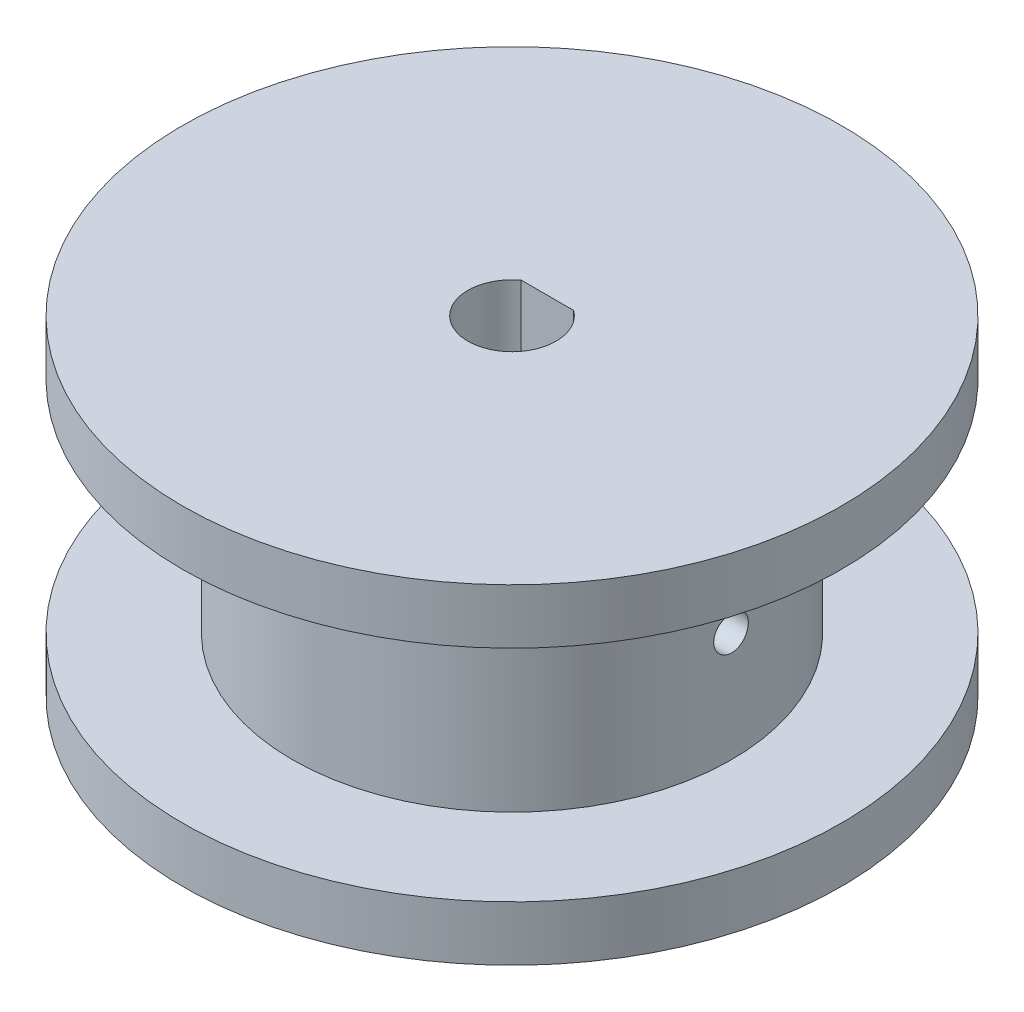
ISO-10303-21;
HEADER;
FILE_DESCRIPTION(('STEP AP214'),'2;1');
FILE_NAME('part.step','',(''),(''),'','','');
FILE_SCHEMA(('AUTOMOTIVE_DESIGN { 1 0 10303 214 1 1 1 1 }'));
ENDSEC;
DATA;
#1=APPLICATION_CONTEXT('core data for automotive mechanical design processes');
#2=APPLICATION_PROTOCOL_DEFINITION('international standard','automotive_design',2000,#1);
#3=PRODUCT_CONTEXT('',#1,'mechanical');
#4=PRODUCT('Part','Part','',(#3));
#5=PRODUCT_RELATED_PRODUCT_CATEGORY('part','',(#4));
#6=PRODUCT_DEFINITION_FORMATION('','',#4);
#7=PRODUCT_DEFINITION_CONTEXT('part definition',#1,'design');
#8=PRODUCT_DEFINITION('design','',#6,#7);
#9=PRODUCT_DEFINITION_SHAPE('','',#8);
#10=(LENGTH_UNIT() NAMED_UNIT(*) SI_UNIT(.MILLI.,.METRE.));
#11=(NAMED_UNIT(*) PLANE_ANGLE_UNIT() SI_UNIT($,.RADIAN.));
#12=(NAMED_UNIT(*) SI_UNIT($,.STERADIAN.) SOLID_ANGLE_UNIT());
#13=UNCERTAINTY_MEASURE_WITH_UNIT(LENGTH_MEASURE(1.E-05),#10,'distance_accuracy_value','');
#14=(GEOMETRIC_REPRESENTATION_CONTEXT(3) GLOBAL_UNCERTAINTY_ASSIGNED_CONTEXT((#13)) GLOBAL_UNIT_ASSIGNED_CONTEXT((#10,
#11,#12)) REPRESENTATION_CONTEXT('',''));
#15=CARTESIAN_POINT('',(0.,0.,0.));
#16=DIRECTION('',(0.,0.,1.));
#17=DIRECTION('',(1.,0.,0.));
#18=AXIS2_PLACEMENT_3D('',#15,#16,#17);
#19=CARTESIAN_POINT('',(0.,-3.175,0.));
#20=DIRECTION('',(0.,-1.,0.));
#21=DIRECTION('',(0.,0.,-1.));
#22=AXIS2_PLACEMENT_3D('',#19,#20,#21);
#23=PLANE('',#22);
#24=CARTESIAN_POINT('',(0.,-3.175,0.));
#25=DIRECTION('',(0.,-1.,0.));
#26=DIRECTION('',(0.,0.,-1.));
#27=AXIS2_PLACEMENT_3D('',#24,#25,#26);
#28=CIRCLE('',#27,19.05);
#29=CARTESIAN_POINT('',(0.,-3.175,-19.05));
#30=VERTEX_POINT('',#29);
#31=EDGE_CURVE('E205',#30,#30,#28,.T.);
#32=ORIENTED_EDGE('',*,*,#31,.T.);
#33=EDGE_LOOP('',(#32));
#34=FACE_BOUND('',#33,.T.);
#35=CARTESIAN_POINT('',(0.,-3.175,0.));
#36=DIRECTION('',(0.,-1.,0.));
#37=DIRECTION('',(0.,0.,-1.));
#38=AXIS2_PLACEMENT_3D('',#35,#36,#37);
#39=CIRCLE('',#38,5.725);
#40=CARTESIAN_POINT('',(0.,-3.175,-5.725));
#41=VERTEX_POINT('',#40);
#42=EDGE_CURVE('E194',#41,#41,#39,.T.);
#43=ORIENTED_EDGE('',*,*,#42,.F.);
#44=EDGE_LOOP('',(#43));
#45=FACE_BOUND('',#44,.T.);
#46=ADVANCED_FACE('F45',(#34,#45),#23,.T.);
#47=CARTESIAN_POINT('',(0.,12.7,0.));
#48=DIRECTION('',(0.,-1.,0.));
#49=DIRECTION('',(0.,0.,-1.));
#50=AXIS2_PLACEMENT_3D('',#47,#48,#49);
#51=CYLINDRICAL_SURFACE('',#50,12.7);
#52=CARTESIAN_POINT('',(-12.6605687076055,6.35,-1.));
#53=CARTESIAN_POINT('',(-12.6605692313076,6.40607694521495,-0.999997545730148));
#54=CARTESIAN_POINT('',(-12.6609452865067,6.46219233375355,-0.995267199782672));
#55=CARTESIAN_POINT('',(-12.6624089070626,6.57287124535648,-0.976466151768));
#56=CARTESIAN_POINT('',(-12.6634972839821,6.62743292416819,-0.962384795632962));
#57=CARTESIAN_POINT('',(-12.6662615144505,6.73338534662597,-0.925290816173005));
#58=CARTESIAN_POINT('',(-12.6679370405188,6.78477783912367,-0.902283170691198));
#59=CARTESIAN_POINT('',(-12.6716863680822,6.88295894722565,-0.847998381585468));
#60=CARTESIAN_POINT('',(-12.6737600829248,6.92974856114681,-0.816723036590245));
#61=CARTESIAN_POINT('',(-12.6780775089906,7.01751616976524,-0.746712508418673));
#62=CARTESIAN_POINT('',(-12.6803215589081,7.05848209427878,-0.707962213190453));
#63=CARTESIAN_POINT('',(-12.6847236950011,7.13333583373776,-0.624133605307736));
#64=CARTESIAN_POINT('',(-12.6868817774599,7.16722334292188,-0.579055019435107));
#65=CARTESIAN_POINT('',(-12.6908719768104,7.22699790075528,-0.483778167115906));
#66=CARTESIAN_POINT('',(-12.6927036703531,7.25287459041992,-0.43357338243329));
#67=CARTESIAN_POINT('',(-12.6958310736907,7.29582669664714,-0.329514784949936));
#68=CARTESIAN_POINT('',(-12.6971267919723,7.3129022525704,-0.275661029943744));
#69=CARTESIAN_POINT('',(-12.6990338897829,7.33773286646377,-0.165952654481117));
#70=CARTESIAN_POINT('',(-12.69964669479,7.34550734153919,-0.110102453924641));
#71=CARTESIAN_POINT('',(-12.7001237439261,7.35157511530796,0.00211328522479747));
#72=CARTESIAN_POINT('',(-12.6999880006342,7.34986857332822,0.058478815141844));
#73=CARTESIAN_POINT('',(-12.698984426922,7.33703866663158,0.169993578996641));
#74=CARTESIAN_POINT('',(-12.6981182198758,7.32593618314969,0.2251452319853));
#75=CARTESIAN_POINT('',(-12.6957530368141,7.2946620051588,0.332799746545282));
#76=CARTESIAN_POINT('',(-12.6942540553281,7.27449023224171,0.385302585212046));
#77=CARTESIAN_POINT('',(-12.6907891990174,7.22562671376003,0.486235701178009));
#78=CARTESIAN_POINT('',(-12.6888228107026,7.19692558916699,0.534661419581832));
#79=CARTESIAN_POINT('',(-12.6846442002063,7.1318248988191,0.626015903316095));
#80=CARTESIAN_POINT('',(-12.6824319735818,7.09542519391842,0.668944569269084));
#81=CARTESIAN_POINT('',(-12.6780033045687,7.01584284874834,0.748208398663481));
#82=CARTESIAN_POINT('',(-12.6757868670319,6.97264206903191,0.784525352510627));
#83=CARTESIAN_POINT('',(-12.6716056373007,6.88074718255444,0.849394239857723));
#84=CARTESIAN_POINT('',(-12.669640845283,6.83205307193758,0.877946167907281));
#85=CARTESIAN_POINT('',(-12.6661849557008,6.73054128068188,0.926473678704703));
#86=CARTESIAN_POINT('',(-12.6646939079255,6.67772316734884,0.946448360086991));
#87=CARTESIAN_POINT('',(-12.6623552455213,6.56946858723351,0.977241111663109));
#88=CARTESIAN_POINT('',(-12.6615076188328,6.51403216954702,0.988059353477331));
#89=CARTESIAN_POINT('',(-12.6605536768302,6.40227383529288,1.00020917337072));
#90=CARTESIAN_POINT('',(-12.6604453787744,6.34595469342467,1.00156612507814));
#91=CARTESIAN_POINT('',(-12.6609771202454,6.23388970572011,0.994821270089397));
#92=CARTESIAN_POINT('',(-12.6616171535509,6.17814385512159,0.986719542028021));
#93=CARTESIAN_POINT('',(-12.6635716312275,6.06888044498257,0.96130844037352));
#94=CARTESIAN_POINT('',(-12.6648852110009,6.01536012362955,0.944010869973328));
#95=CARTESIAN_POINT('',(-12.6680380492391,5.91198153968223,0.900711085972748));
#96=CARTESIAN_POINT('',(-12.6698773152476,5.86212332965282,0.874708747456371));
#97=CARTESIAN_POINT('',(-12.6738790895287,5.7673680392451,0.814673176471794));
#98=CARTESIAN_POINT('',(-12.6760422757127,5.72248171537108,0.780623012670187));
#99=CARTESIAN_POINT('',(-12.6804458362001,5.63905298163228,0.705482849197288));
#100=CARTESIAN_POINT('',(-12.6826862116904,5.60051066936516,0.6643927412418));
#101=CARTESIAN_POINT('',(-12.6869975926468,5.53077764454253,0.576229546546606));
#102=CARTESIAN_POINT('',(-12.6890682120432,5.4996034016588,0.529143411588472));
#103=CARTESIAN_POINT('',(-12.6928012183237,5.44560436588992,0.43038992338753));
#104=CARTESIAN_POINT('',(-12.6944636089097,5.42277949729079,0.378722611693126));
#105=CARTESIAN_POINT('',(-12.6971910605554,5.38615549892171,0.272332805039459));
#106=CARTESIAN_POINT('',(-12.6982567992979,5.37234612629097,0.21761385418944));
#107=CARTESIAN_POINT('',(-12.6996736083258,5.35411162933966,0.106625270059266));
#108=CARTESIAN_POINT('',(-12.7000246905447,5.34968634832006,0.050355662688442));
#109=CARTESIAN_POINT('',(-12.6999726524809,5.35034739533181,-0.0619744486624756));
#110=CARTESIAN_POINT('',(-12.6995715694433,5.35540803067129,-0.118035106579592));
#111=CARTESIAN_POINT('',(-12.6980643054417,5.37484375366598,-0.228507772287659));
#112=CARTESIAN_POINT('',(-12.6969581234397,5.38921885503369,-0.282919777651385));
#113=CARTESIAN_POINT('',(-12.6941648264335,5.42686908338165,-0.388552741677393));
#114=CARTESIAN_POINT('',(-12.6924777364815,5.4501438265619,-0.439773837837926));
#115=CARTESIAN_POINT('',(-12.6887115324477,5.50492961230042,-0.537585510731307));
#116=CARTESIAN_POINT('',(-12.6866324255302,5.5364405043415,-0.584176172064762));
#117=CARTESIAN_POINT('',(-12.6823089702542,5.60690040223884,-0.671535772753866));
#118=CARTESIAN_POINT('',(-12.6800642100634,5.64586835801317,-0.712289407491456));
#119=CARTESIAN_POINT('',(-12.6756659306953,5.73010333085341,-0.786693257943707));
#120=CARTESIAN_POINT('',(-12.6735124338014,5.7753718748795,-0.820341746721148));
#121=CARTESIAN_POINT('',(-12.669536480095,5.87100188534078,-0.87962053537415));
#122=CARTESIAN_POINT('',(-12.667714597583,5.92137195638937,-0.905236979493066));
#123=CARTESIAN_POINT('',(-12.6646152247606,6.02567769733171,-0.9476164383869));
#124=CARTESIAN_POINT('',(-12.6633371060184,6.079609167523,-0.964389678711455));
#125=CARTESIAN_POINT('',(-12.6618002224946,6.16988481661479,-0.984313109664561));
#126=CARTESIAN_POINT('',(-12.6613405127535,6.20564762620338,-0.990187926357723));
#127=CARTESIAN_POINT('',(-12.6607245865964,6.27760161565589,-0.998032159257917));
#128=CARTESIAN_POINT('',(-12.6605683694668,6.31379279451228,-1.0000015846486));
#129=CARTESIAN_POINT('',(-12.6605687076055,6.35,-1.));
#130=B_SPLINE_CURVE_WITH_KNOTS('',3,(#52,#53,#54,#55,#56,#57,#58,#59,#60,#61,#62,#63,#64,#65,
#66,#67,#68,#69,#70,#71,#72,#73,#74,#75,#76,#77,#78,#79,#80,#81,#82,#83,#84,#85,#86,#87,#88,#89,
#90,#91,#92,#93,#94,#95,#96,#97,#98,#99,#100,#101,#102,#103,#104,#105,#106,#107,#108,#109,#110,
#111,#112,#113,#114,#115,#116,#117,#118,#119,#120,#121,#122,#123,#124,#125,#126,#127,#128,#129),
.UNSPECIFIED.,.T.,.F.,(4,2,2,2,2,2,2,2,2,2,2,2,2,2,2,2,2,2,2,2,2,2,2,2,2,2,2,2,2,2,2,2,2,2,2,2,
2,2,4),(0.,0.168098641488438,0.336389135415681,0.504585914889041,0.672746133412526,
0.841249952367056,1.00976104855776,1.17848914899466,1.34721457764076,1.51558715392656,
1.68395690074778,1.85195344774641,2.01995144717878,2.18813486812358,2.35632132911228,
2.52496421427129,2.69360721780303,2.86226793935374,3.03092549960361,3.1991305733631,
3.36733424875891,3.53532254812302,3.7033132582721,3.87166059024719,4.04001051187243,
4.20873325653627,4.37745447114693,4.54598365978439,4.71451003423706,4.88258061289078,
5.05065143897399,5.2187150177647,5.38677552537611,5.55526892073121,5.72380322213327,
5.89262667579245,6.06125448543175,6.16979100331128,6.27832726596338),.UNSPECIFIED.);
#131=CARTESIAN_POINT('',(-12.6605687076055,6.35,-1.));
#132=VERTEX_POINT('',#131);
#133=EDGE_CURVE('E96',#132,#132,#130,.T.);
#134=ORIENTED_EDGE('',*,*,#133,.T.);
#135=EDGE_LOOP('',(#134));
#136=FACE_BOUND('',#135,.T.);
#137=CARTESIAN_POINT('',(12.6605687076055,6.35,-1.));
#138=CARTESIAN_POINT('',(12.6605692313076,6.29392305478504,-0.999997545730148));
#139=CARTESIAN_POINT('',(12.6609452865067,6.23780766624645,-0.995267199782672));
#140=CARTESIAN_POINT('',(12.6624089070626,6.12712875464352,-0.976466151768));
#141=CARTESIAN_POINT('',(12.6634972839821,6.07256707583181,-0.962384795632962));
#142=CARTESIAN_POINT('',(12.6662615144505,5.96661465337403,-0.925290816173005));
#143=CARTESIAN_POINT('',(12.6679370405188,5.91522216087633,-0.902283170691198));
#144=CARTESIAN_POINT('',(12.6716863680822,5.81704105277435,-0.847998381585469));
#145=CARTESIAN_POINT('',(12.6737600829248,5.77025143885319,-0.816723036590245));
#146=CARTESIAN_POINT('',(12.6780775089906,5.68248383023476,-0.746712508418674));
#147=CARTESIAN_POINT('',(12.6803215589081,5.64151790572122,-0.707962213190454));
#148=CARTESIAN_POINT('',(12.6847236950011,5.56666416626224,-0.624133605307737));
#149=CARTESIAN_POINT('',(12.6868817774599,5.53277665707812,-0.579055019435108));
#150=CARTESIAN_POINT('',(12.6908719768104,5.47300209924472,-0.483778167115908));
#151=CARTESIAN_POINT('',(12.6927036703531,5.44712540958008,-0.433573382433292));
#152=CARTESIAN_POINT('',(12.6958310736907,5.40417330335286,-0.329514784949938));
#153=CARTESIAN_POINT('',(12.6971267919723,5.3870977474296,-0.275661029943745));
#154=CARTESIAN_POINT('',(12.6990338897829,5.36226713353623,-0.165952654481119));
#155=CARTESIAN_POINT('',(12.69964669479,5.35449265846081,-0.110102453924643));
#156=CARTESIAN_POINT('',(12.7001237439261,5.34842488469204,0.00211328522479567));
#157=CARTESIAN_POINT('',(12.6999880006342,5.35013142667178,0.0584788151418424));
#158=CARTESIAN_POINT('',(12.698984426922,5.36296133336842,0.169993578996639));
#159=CARTESIAN_POINT('',(12.6981182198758,5.3740638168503,0.225145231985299));
#160=CARTESIAN_POINT('',(12.6957530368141,5.4053379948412,0.332799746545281));
#161=CARTESIAN_POINT('',(12.6942540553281,5.42550976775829,0.385302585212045));
#162=CARTESIAN_POINT('',(12.6907891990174,5.47437328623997,0.486235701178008));
#163=CARTESIAN_POINT('',(12.6888228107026,5.50307441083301,0.534661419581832));
#164=CARTESIAN_POINT('',(12.6846442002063,5.5681751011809,0.626015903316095));
#165=CARTESIAN_POINT('',(12.6824319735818,5.60457480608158,0.668944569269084));
#166=CARTESIAN_POINT('',(12.6780033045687,5.68415715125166,0.748208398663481));
#167=CARTESIAN_POINT('',(12.6757868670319,5.72735793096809,0.784525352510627));
#168=CARTESIAN_POINT('',(12.6716056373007,5.81925281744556,0.849394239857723));
#169=CARTESIAN_POINT('',(12.669640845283,5.86794692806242,0.877946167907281));
#170=CARTESIAN_POINT('',(12.6661849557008,5.96945871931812,0.926473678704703));
#171=CARTESIAN_POINT('',(12.6646939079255,6.02227683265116,0.946448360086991));
#172=CARTESIAN_POINT('',(12.6623552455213,6.13053141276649,0.977241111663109));
#173=CARTESIAN_POINT('',(12.6615076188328,6.18596783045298,0.988059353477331));
#174=CARTESIAN_POINT('',(12.6605536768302,6.29772616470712,1.00020917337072));
#175=CARTESIAN_POINT('',(12.6604453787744,6.35404530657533,1.00156612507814));
#176=CARTESIAN_POINT('',(12.6609771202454,6.46611029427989,0.994821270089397));
#177=CARTESIAN_POINT('',(12.6616171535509,6.52185614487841,0.986719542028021));
#178=CARTESIAN_POINT('',(12.6635716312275,6.63111955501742,0.961308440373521));
#179=CARTESIAN_POINT('',(12.6648852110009,6.68463987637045,0.944010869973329));
#180=CARTESIAN_POINT('',(12.6680380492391,6.78801846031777,0.900711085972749));
#181=CARTESIAN_POINT('',(12.6698773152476,6.83787667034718,0.874708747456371));
#182=CARTESIAN_POINT('',(12.6738790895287,6.9326319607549,0.814673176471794));
#183=CARTESIAN_POINT('',(12.6760422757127,6.97751828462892,0.780623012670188));
#184=CARTESIAN_POINT('',(12.6804458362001,7.06094701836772,0.705482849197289));
#185=CARTESIAN_POINT('',(12.6826862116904,7.09948933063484,0.664392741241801));
#186=CARTESIAN_POINT('',(12.6869975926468,7.16922235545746,0.576229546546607));
#187=CARTESIAN_POINT('',(12.6890682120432,7.20039659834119,0.529143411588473));
#188=CARTESIAN_POINT('',(12.6928012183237,7.25439563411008,0.430389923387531));
#189=CARTESIAN_POINT('',(12.6944636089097,7.27722050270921,0.378722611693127));
#190=CARTESIAN_POINT('',(12.6971910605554,7.31384450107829,0.27233280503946));
#191=CARTESIAN_POINT('',(12.6982567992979,7.32765387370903,0.217613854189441));
#192=CARTESIAN_POINT('',(12.6996736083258,7.34588837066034,0.106625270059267));
#193=CARTESIAN_POINT('',(12.7000246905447,7.35031365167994,0.0503556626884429));
#194=CARTESIAN_POINT('',(12.6999726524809,7.34965260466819,-0.0619744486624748));
#195=CARTESIAN_POINT('',(12.6995715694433,7.34459196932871,-0.118035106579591));
#196=CARTESIAN_POINT('',(12.6980643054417,7.32515624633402,-0.228507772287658));
#197=CARTESIAN_POINT('',(12.6969581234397,7.31078114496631,-0.282919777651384));
#198=CARTESIAN_POINT('',(12.6941648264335,7.27313091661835,-0.388552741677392));
#199=CARTESIAN_POINT('',(12.6924777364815,7.2498561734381,-0.439773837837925));
#200=CARTESIAN_POINT('',(12.6887115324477,7.19507038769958,-0.537585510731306));
#201=CARTESIAN_POINT('',(12.6866324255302,7.1635594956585,-0.584176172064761));
#202=CARTESIAN_POINT('',(12.6823089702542,7.09309959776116,-0.671535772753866));
#203=CARTESIAN_POINT('',(12.6800642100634,7.05413164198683,-0.712289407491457));
#204=CARTESIAN_POINT('',(12.6756659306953,6.96989666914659,-0.786693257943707));
#205=CARTESIAN_POINT('',(12.6735124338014,6.9246281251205,-0.820341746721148));
#206=CARTESIAN_POINT('',(12.669536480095,6.82899811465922,-0.87962053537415));
#207=CARTESIAN_POINT('',(12.667714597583,6.77862804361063,-0.905236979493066));
#208=CARTESIAN_POINT('',(12.6646152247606,6.67432230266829,-0.9476164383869));
#209=CARTESIAN_POINT('',(12.6633371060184,6.620390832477,-0.964389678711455));
#210=CARTESIAN_POINT('',(12.6618002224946,6.53011518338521,-0.984313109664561));
#211=CARTESIAN_POINT('',(12.6613405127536,6.49435237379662,-0.990187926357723));
#212=CARTESIAN_POINT('',(12.6607245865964,6.42239838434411,-0.998032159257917));
#213=CARTESIAN_POINT('',(12.6605683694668,6.38620720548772,-1.0000015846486));
#214=CARTESIAN_POINT('',(12.6605687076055,6.35,-1.));
#215=B_SPLINE_CURVE_WITH_KNOTS('',3,(#137,#138,#139,#140,#141,#142,#143,#144,#145,#146,#147,
#148,#149,#150,#151,#152,#153,#154,#155,#156,#157,#158,#159,#160,#161,#162,#163,#164,#165,#166,
#167,#168,#169,#170,#171,#172,#173,#174,#175,#176,#177,#178,#179,#180,#181,#182,#183,#184,#185,
#186,#187,#188,#189,#190,#191,#192,#193,#194,#195,#196,#197,#198,#199,#200,#201,#202,#203,#204,
#205,#206,#207,#208,#209,#210,#211,#212,#213,#214),.UNSPECIFIED.,.T.,.F.,(4,2,2,2,2,2,2,2,2,2,2,
2,2,2,2,2,2,2,2,2,2,2,2,2,2,2,2,2,2,2,2,2,2,2,2,2,2,2,4),(0.,0.168098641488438,0.33638913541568,
0.50458591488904,0.672746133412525,0.841249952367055,1.00976104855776,1.17848914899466,
1.34721457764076,1.51558715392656,1.68395690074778,1.85195344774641,2.01995144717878,
2.18813486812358,2.35632132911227,2.52496421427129,2.69360721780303,2.86226793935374,
3.03092549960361,3.1991305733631,3.36733424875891,3.53532254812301,3.7033132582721,
3.87166059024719,4.04001051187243,4.20873325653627,4.37745447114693,4.54598365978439,
4.71451003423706,4.88258061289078,5.05065143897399,5.2187150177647,5.38677552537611,
5.55526892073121,5.72380322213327,5.89262667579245,6.06125448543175,6.16979100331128,
6.27832726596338),.UNSPECIFIED.);
#216=CARTESIAN_POINT('',(12.6605687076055,6.35,-1.));
#217=VERTEX_POINT('',#216);
#218=EDGE_CURVE('E100',#217,#217,#215,.T.);
#219=ORIENTED_EDGE('',*,*,#218,.T.);
#220=EDGE_LOOP('',(#219));
#221=FACE_BOUND('',#220,.T.);
#222=CARTESIAN_POINT('',(0.,12.7,0.));
#223=DIRECTION('',(0.,1.,0.));
#224=DIRECTION('',(0.,0.,1.));
#225=AXIS2_PLACEMENT_3D('',#222,#223,#224);
#226=CIRCLE('',#225,12.7);
#227=CARTESIAN_POINT('',(0.,12.7,12.7));
#228=VERTEX_POINT('',#227);
#229=EDGE_CURVE('E11',#228,#228,#226,.T.);
#230=ORIENTED_EDGE('',*,*,#229,.F.);
#231=EDGE_LOOP('',(#230));
#232=FACE_BOUND('',#231,.T.);
#233=CARTESIAN_POINT('',(0.,0.,0.));
#234=DIRECTION('',(0.,1.,0.));
#235=DIRECTION('',(0.,0.,1.));
#236=AXIS2_PLACEMENT_3D('',#233,#234,#235);
#237=CIRCLE('',#236,12.7);
#238=CARTESIAN_POINT('',(0.,0.,12.7));
#239=VERTEX_POINT('',#238);
#240=EDGE_CURVE('E86',#239,#239,#237,.T.);
#241=ORIENTED_EDGE('',*,*,#240,.T.);
#242=EDGE_LOOP('',(#241));
#243=FACE_BOUND('',#242,.T.);
#244=ADVANCED_FACE('F47',(#136,#221,#232,#243),#51,.T.);
#245=CARTESIAN_POINT('',(0.,12.7,0.));
#246=DIRECTION('',(0.,-1.,0.));
#247=DIRECTION('',(0.,0.,-1.));
#248=AXIS2_PLACEMENT_3D('',#245,#246,#247);
#249=CYLINDRICAL_SURFACE('',#248,2.55);
#250=CARTESIAN_POINT('',(-2.34574082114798,6.35,-1.));
#251=CARTESIAN_POINT('',(-2.3457459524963,6.4036657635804,-0.999994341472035));
#252=CARTESIAN_POINT('',(-2.34760842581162,6.45741276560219,-0.995654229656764));
#253=CARTESIAN_POINT('',(-2.35482732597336,6.56337079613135,-0.978452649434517));
#254=CARTESIAN_POINT('',(-2.36019288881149,6.61557743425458,-0.965568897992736));
#255=CARTESIAN_POINT('',(-2.37370944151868,6.71674471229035,-0.931842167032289));
#256=CARTESIAN_POINT('',(-2.38185018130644,6.76571651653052,-0.91102844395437));
#257=CARTESIAN_POINT('',(-2.39998553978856,6.8594606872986,-0.862117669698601));
#258=CARTESIAN_POINT('',(-2.40997970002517,6.90423408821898,-0.834022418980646));
#259=CARTESIAN_POINT('',(-2.4313109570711,6.9907971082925,-0.769694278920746));
#260=CARTESIAN_POINT('',(-2.44269014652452,7.03232708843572,-0.733125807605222));
#261=CARTESIAN_POINT('',(-2.4651609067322,7.10885366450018,-0.653596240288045));
#262=CARTESIAN_POINT('',(-2.47625237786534,7.14384802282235,-0.610632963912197));
#263=CARTESIAN_POINT('',(-2.49740018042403,7.20758200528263,-0.517543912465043));
#264=CARTESIAN_POINT('',(-2.5074017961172,7.23603643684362,-0.467209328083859));
#265=CARTESIAN_POINT('',(-2.52473513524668,7.28396413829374,-0.362005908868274));
#266=CARTESIAN_POINT('',(-2.53206790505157,7.30344092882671,-0.307138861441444));
#267=CARTESIAN_POINT('',(-2.54293964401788,7.33194068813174,-0.197148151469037));
#268=CARTESIAN_POINT('',(-2.54663989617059,7.34140966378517,-0.142156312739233));
#269=CARTESIAN_POINT('',(-2.55041130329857,7.35105888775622,-0.0312480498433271));
#270=CARTESIAN_POINT('',(-2.55048375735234,7.35124246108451,0.0246680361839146));
#271=CARTESIAN_POINT('',(-2.54709098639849,7.34256509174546,0.132622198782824));
#272=CARTESIAN_POINT('',(-2.54381667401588,7.33419224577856,0.18470658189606));
#273=CARTESIAN_POINT('',(-2.53435339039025,7.30946698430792,0.286662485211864));
#274=CARTESIAN_POINT('',(-2.52816420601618,7.29311398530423,0.336533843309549));
#275=CARTESIAN_POINT('',(-2.51336255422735,7.2526899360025,0.433536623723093));
#276=CARTESIAN_POINT('',(-2.50471526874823,7.22850724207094,0.480615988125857));
#277=CARTESIAN_POINT('',(-2.48586099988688,7.17321291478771,0.570168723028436));
#278=CARTESIAN_POINT('',(-2.47565349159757,7.14209894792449,0.612640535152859));
#279=CARTESIAN_POINT('',(-2.4539560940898,7.07152411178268,0.694629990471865));
#280=CARTESIAN_POINT('',(-2.44242593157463,7.03165912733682,0.733789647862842));
#281=CARTESIAN_POINT('',(-2.4198876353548,6.94587491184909,0.805010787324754));
#282=CARTESIAN_POINT('',(-2.4088796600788,6.89995385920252,0.83707012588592));
#283=CARTESIAN_POINT('',(-2.38836452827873,6.80182110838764,0.893955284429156));
#284=CARTESIAN_POINT('',(-2.37890432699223,6.74947597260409,0.918569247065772));
#285=CARTESIAN_POINT('',(-2.3631035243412,6.6409141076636,0.958492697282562));
#286=CARTESIAN_POINT('',(-2.35676099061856,6.58469980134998,0.973807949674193));
#287=CARTESIAN_POINT('',(-2.34837835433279,6.47355678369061,0.993846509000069));
#288=CARTESIAN_POINT('',(-2.34610556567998,6.41874929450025,0.999143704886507));
#289=CARTESIAN_POINT('',(-2.34545810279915,6.30899340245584,1.00066387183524));
#290=CARTESIAN_POINT('',(-2.34708231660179,6.25404504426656,0.996889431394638));
#291=CARTESIAN_POINT('',(-2.35380782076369,6.1486743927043,0.980895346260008));
#292=CARTESIAN_POINT('',(-2.35871719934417,6.09816769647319,0.969141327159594));
#293=CARTESIAN_POINT('',(-2.37122513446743,5.99987343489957,0.938119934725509));
#294=CARTESIAN_POINT('',(-2.37882427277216,5.95208646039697,0.91885093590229));
#295=CARTESIAN_POINT('',(-2.39622464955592,5.85847795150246,0.872491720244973));
#296=CARTESIAN_POINT('',(-2.40610122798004,5.81280937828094,0.845121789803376));
#297=CARTESIAN_POINT('',(-2.42682507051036,5.72651124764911,0.783627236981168));
#298=CARTESIAN_POINT('',(-2.43767271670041,5.68588368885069,0.749499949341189));
#299=CARTESIAN_POINT('',(-2.46003975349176,5.6078467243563,0.672618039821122));
#300=CARTESIAN_POINT('',(-2.47155261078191,5.57086587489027,0.629424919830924));
#301=CARTESIAN_POINT('',(-2.49322939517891,5.50461562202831,0.537168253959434));
#302=CARTESIAN_POINT('',(-2.50339328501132,5.47534643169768,0.488104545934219));
#303=CARTESIAN_POINT('',(-2.52124549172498,5.42548853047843,0.385397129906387));
#304=CARTESIAN_POINT('',(-2.52893718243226,5.4048879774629,0.331759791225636));
#305=CARTESIAN_POINT('',(-2.5409747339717,5.37313209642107,0.221406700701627));
#306=CARTESIAN_POINT('',(-2.54532233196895,5.36197186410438,0.164692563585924));
#307=CARTESIAN_POINT('',(-2.5500028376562,5.34997912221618,0.0536515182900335));
#308=CARTESIAN_POINT('',(-2.55057159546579,5.34853979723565,-0.000600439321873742));
#309=CARTESIAN_POINT('',(-2.54826037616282,5.35444055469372,-0.108544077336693));
#310=CARTESIAN_POINT('',(-2.54538088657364,5.36177939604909,-0.162235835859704));
#311=CARTESIAN_POINT('',(-2.53661158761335,5.38459635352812,-0.265963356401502));
#312=CARTESIAN_POINT('',(-2.53081033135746,5.39983540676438,-0.316059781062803));
#313=CARTESIAN_POINT('',(-2.51681296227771,5.43777341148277,-0.412980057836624));
#314=CARTESIAN_POINT('',(-2.50861639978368,5.46047376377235,-0.459803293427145));
#315=CARTESIAN_POINT('',(-2.49019346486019,5.51380866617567,-0.551089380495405));
#316=CARTESIAN_POINT('',(-2.47989417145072,5.54474600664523,-0.595360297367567));
#317=CARTESIAN_POINT('',(-2.4585144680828,5.61321641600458,-0.678264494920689));
#318=CARTESIAN_POINT('',(-2.44743375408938,5.65075206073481,-0.71689556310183));
#319=CARTESIAN_POINT('',(-2.42493148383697,5.73397302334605,-0.789776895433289));
#320=CARTESIAN_POINT('',(-2.41352837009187,5.78000843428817,-0.823634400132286));
#321=CARTESIAN_POINT('',(-2.39238817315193,5.87747834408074,-0.883165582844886));
#322=CARTESIAN_POINT('',(-2.38265131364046,5.92891356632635,-0.908838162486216));
#323=CARTESIAN_POINT('',(-2.36682265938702,6.03113776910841,-0.949252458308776));
#324=CARTESIAN_POINT('',(-2.36048637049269,6.08158906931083,-0.964754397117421));
#325=CARTESIAN_POINT('',(-2.35101809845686,6.18450486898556,-0.987609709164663));
#326=CARTESIAN_POINT('',(-2.34787707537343,6.2369632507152,-0.99498607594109));
#327=CARTESIAN_POINT('',(-2.3459984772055,6.30973760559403,-0.999393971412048));
#328=CARTESIAN_POINT('',(-2.34573889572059,6.32986308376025,-1.00000212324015));
#329=CARTESIAN_POINT('',(-2.34574082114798,6.35,-1.));
#330=B_SPLINE_CURVE_WITH_KNOTS('',3,(#250,#251,#252,#253,#254,#255,#256,#257,#258,#259,#260,
#261,#262,#263,#264,#265,#266,#267,#268,#269,#270,#271,#272,#273,#274,#275,#276,#277,#278,#279,
#280,#281,#282,#283,#284,#285,#286,#287,#288,#289,#290,#291,#292,#293,#294,#295,#296,#297,#298,
#299,#300,#301,#302,#303,#304,#305,#306,#307,#308,#309,#310,#311,#312,#313,#314,#315,#316,#317,
#318,#319,#320,#321,#322,#323,#324,#325,#326,#327,#328,#329),.UNSPECIFIED.,.T.,.F.,(4,2,2,2,2,2,
2,2,2,2,2,2,2,2,2,2,2,2,2,2,2,2,2,2,2,2,2,2,2,2,2,2,2,2,2,2,2,2,2,4),(0.,0.160936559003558,
0.322294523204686,0.483062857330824,0.643791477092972,0.812524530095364,0.981315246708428,
1.15646276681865,1.33154154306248,1.49843825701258,1.66527520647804,1.82309874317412,
1.98093382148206,2.14112665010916,2.3013734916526,2.47177947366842,2.64223682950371,
2.81716652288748,2.99198765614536,3.15644901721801,3.32086345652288,3.47642592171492,
3.63202205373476,3.79378498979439,3.95561185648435,4.12884294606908,4.30207882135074,
4.47507726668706,4.64798578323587,4.80999207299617,4.97197546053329,5.12932088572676,
5.28669586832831,5.45093271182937,5.61523381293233,5.78922532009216,5.96324016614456,
6.1220198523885,6.28034906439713,6.34073702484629),.UNSPECIFIED.);
#331=CARTESIAN_POINT('',(-2.34574082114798,6.35,-1.));
#332=VERTEX_POINT('',#331);
#333=EDGE_CURVE('E50',#332,#332,#330,.T.);
#334=ORIENTED_EDGE('',*,*,#333,.F.);
#335=EDGE_LOOP('',(#334));
#336=FACE_BOUND('',#335,.T.);
#337=CARTESIAN_POINT('',(2.34574082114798,6.35,-1.));
#338=CARTESIAN_POINT('',(2.34574595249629,6.2963342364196,-0.999994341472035));
#339=CARTESIAN_POINT('',(2.34760842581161,6.24258723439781,-0.995654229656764));
#340=CARTESIAN_POINT('',(2.35482732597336,6.13662920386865,-0.978452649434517));
#341=CARTESIAN_POINT('',(2.36019288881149,6.08442256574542,-0.965568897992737));
#342=CARTESIAN_POINT('',(2.37370944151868,5.98325528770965,-0.93184216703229));
#343=CARTESIAN_POINT('',(2.38185018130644,5.93428348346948,-0.911028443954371));
#344=CARTESIAN_POINT('',(2.39998553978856,5.84053931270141,-0.862117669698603));
#345=CARTESIAN_POINT('',(2.40997970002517,5.79576591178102,-0.834022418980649));
#346=CARTESIAN_POINT('',(2.4313109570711,5.7092028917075,-0.769694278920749));
#347=CARTESIAN_POINT('',(2.44269014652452,5.66767291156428,-0.733125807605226));
#348=CARTESIAN_POINT('',(2.4651609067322,5.59114633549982,-0.653596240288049));
#349=CARTESIAN_POINT('',(2.47625237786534,5.55615197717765,-0.610632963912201));
#350=CARTESIAN_POINT('',(2.49740018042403,5.49241799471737,-0.517543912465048));
#351=CARTESIAN_POINT('',(2.50740179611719,5.46396356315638,-0.467209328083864));
#352=CARTESIAN_POINT('',(2.52473513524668,5.41603586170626,-0.36200590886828));
#353=CARTESIAN_POINT('',(2.53206790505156,5.39655907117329,-0.307138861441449));
#354=CARTESIAN_POINT('',(2.54293964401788,5.36805931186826,-0.197148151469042));
#355=CARTESIAN_POINT('',(2.54663989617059,5.35859033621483,-0.142156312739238));
#356=CARTESIAN_POINT('',(2.55041130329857,5.34894111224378,-0.0312480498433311));
#357=CARTESIAN_POINT('',(2.55048375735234,5.34875753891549,0.0246680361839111));
#358=CARTESIAN_POINT('',(2.54709098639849,5.35743490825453,0.132622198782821));
#359=CARTESIAN_POINT('',(2.54381667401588,5.36580775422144,0.184706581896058));
#360=CARTESIAN_POINT('',(2.53435339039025,5.39053301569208,0.286662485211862));
#361=CARTESIAN_POINT('',(2.52816420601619,5.40688601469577,0.336533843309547));
#362=CARTESIAN_POINT('',(2.51336255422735,5.4473100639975,0.433536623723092));
#363=CARTESIAN_POINT('',(2.50471526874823,5.47149275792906,0.480615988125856));
#364=CARTESIAN_POINT('',(2.48586099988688,5.52678708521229,0.570168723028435));
#365=CARTESIAN_POINT('',(2.47565349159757,5.55790105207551,0.612640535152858));
#366=CARTESIAN_POINT('',(2.4539560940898,5.62847588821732,0.694629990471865));
#367=CARTESIAN_POINT('',(2.44242593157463,5.66834087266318,0.733789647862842));
#368=CARTESIAN_POINT('',(2.4198876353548,5.75412508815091,0.805010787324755));
#369=CARTESIAN_POINT('',(2.4088796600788,5.80004614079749,0.83707012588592));
#370=CARTESIAN_POINT('',(2.38836452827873,5.89817889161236,0.893955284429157));
#371=CARTESIAN_POINT('',(2.37890432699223,5.95052402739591,0.918569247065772));
#372=CARTESIAN_POINT('',(2.3631035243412,6.0590858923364,0.958492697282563));
#373=CARTESIAN_POINT('',(2.35676099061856,6.11530019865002,0.973807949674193));
#374=CARTESIAN_POINT('',(2.34837835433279,6.22644321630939,0.993846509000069));
#375=CARTESIAN_POINT('',(2.34610556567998,6.28125070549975,0.999143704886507));
#376=CARTESIAN_POINT('',(2.34545810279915,6.39100659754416,1.00066387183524));
#377=CARTESIAN_POINT('',(2.34708231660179,6.44595495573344,0.996889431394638));
#378=CARTESIAN_POINT('',(2.35380782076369,6.5513256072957,0.980895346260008));
#379=CARTESIAN_POINT('',(2.35871719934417,6.60183230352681,0.969141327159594));
#380=CARTESIAN_POINT('',(2.37122513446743,6.70012656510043,0.93811993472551));
#381=CARTESIAN_POINT('',(2.37882427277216,6.74791353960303,0.918850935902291));
#382=CARTESIAN_POINT('',(2.39622464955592,6.84152204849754,0.872491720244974));
#383=CARTESIAN_POINT('',(2.40610122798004,6.88719062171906,0.845121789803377));
#384=CARTESIAN_POINT('',(2.42682507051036,6.97348875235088,0.783627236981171));
#385=CARTESIAN_POINT('',(2.4376727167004,7.0141163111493,0.749499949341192));
#386=CARTESIAN_POINT('',(2.46003975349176,7.0921532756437,0.672618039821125));
#387=CARTESIAN_POINT('',(2.47155261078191,7.12913412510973,0.629424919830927));
#388=CARTESIAN_POINT('',(2.49322939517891,7.19538437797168,0.537168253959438));
#389=CARTESIAN_POINT('',(2.50339328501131,7.22465356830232,0.488104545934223));
#390=CARTESIAN_POINT('',(2.52124549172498,7.27451146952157,0.385397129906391));
#391=CARTESIAN_POINT('',(2.52893718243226,7.2951120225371,0.331759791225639));
#392=CARTESIAN_POINT('',(2.5409747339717,7.32686790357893,0.22140670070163));
#393=CARTESIAN_POINT('',(2.54532233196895,7.33802813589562,0.164692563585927));
#394=CARTESIAN_POINT('',(2.5500028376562,7.35002087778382,0.0536515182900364));
#395=CARTESIAN_POINT('',(2.55057159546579,7.35146020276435,-0.000600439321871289));
#396=CARTESIAN_POINT('',(2.54826037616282,7.34555944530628,-0.108544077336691));
#397=CARTESIAN_POINT('',(2.54538088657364,7.33822060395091,-0.162235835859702));
#398=CARTESIAN_POINT('',(2.53661158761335,7.31540364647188,-0.2659633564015));
#399=CARTESIAN_POINT('',(2.53081033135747,7.30016459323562,-0.316059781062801));
#400=CARTESIAN_POINT('',(2.51681296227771,7.26222658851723,-0.412980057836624));
#401=CARTESIAN_POINT('',(2.50861639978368,7.23952623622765,-0.459803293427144));
#402=CARTESIAN_POINT('',(2.49019346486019,7.18619133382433,-0.551089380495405));
#403=CARTESIAN_POINT('',(2.47989417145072,7.15525399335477,-0.595360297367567));
#404=CARTESIAN_POINT('',(2.4585144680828,7.08678358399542,-0.678264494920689));
#405=CARTESIAN_POINT('',(2.44743375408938,7.04924793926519,-0.71689556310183));
#406=CARTESIAN_POINT('',(2.42493148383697,6.96602697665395,-0.789776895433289));
#407=CARTESIAN_POINT('',(2.41352837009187,6.91999156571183,-0.823634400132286));
#408=CARTESIAN_POINT('',(2.39238817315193,6.82252165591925,-0.883165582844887));
#409=CARTESIAN_POINT('',(2.38265131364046,6.77108643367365,-0.908838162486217));
#410=CARTESIAN_POINT('',(2.36682265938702,6.66886223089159,-0.949252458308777));
#411=CARTESIAN_POINT('',(2.36048637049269,6.61841093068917,-0.964754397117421));
#412=CARTESIAN_POINT('',(2.35101809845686,6.51549513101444,-0.987609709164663));
#413=CARTESIAN_POINT('',(2.34787707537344,6.4630367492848,-0.99498607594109));
#414=CARTESIAN_POINT('',(2.3459984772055,6.39026239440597,-0.999393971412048));
#415=CARTESIAN_POINT('',(2.34573889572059,6.37013691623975,-1.00000212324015));
#416=CARTESIAN_POINT('',(2.34574082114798,6.35,-1.));
#417=B_SPLINE_CURVE_WITH_KNOTS('',3,(#337,#338,#339,#340,#341,#342,#343,#344,#345,#346,#347,
#348,#349,#350,#351,#352,#353,#354,#355,#356,#357,#358,#359,#360,#361,#362,#363,#364,#365,#366,
#367,#368,#369,#370,#371,#372,#373,#374,#375,#376,#377,#378,#379,#380,#381,#382,#383,#384,#385,
#386,#387,#388,#389,#390,#391,#392,#393,#394,#395,#396,#397,#398,#399,#400,#401,#402,#403,#404,
#405,#406,#407,#408,#409,#410,#411,#412,#413,#414,#415,#416),.UNSPECIFIED.,.T.,.F.,(4,2,2,2,2,2,
2,2,2,2,2,2,2,2,2,2,2,2,2,2,2,2,2,2,2,2,2,2,2,2,2,2,2,2,2,2,2,2,2,4),(0.,0.160936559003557,
0.322294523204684,0.483062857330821,0.643791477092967,0.812524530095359,0.981315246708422,
1.15646276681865,1.33154154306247,1.49843825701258,1.66527520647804,1.82309874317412,
1.98093382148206,2.14112665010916,2.3013734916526,2.47177947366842,2.64223682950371,
2.81716652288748,2.99198765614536,3.15644901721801,3.32086345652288,3.47642592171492,
3.63202205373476,3.79378498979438,3.95561185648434,4.12884294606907,4.30207882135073,
4.47507726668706,4.64798578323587,4.80999207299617,4.97197546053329,5.12932088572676,
5.28669586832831,5.45093271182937,5.61523381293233,5.78922532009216,5.96324016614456,
6.1220198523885,6.28034906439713,6.34073702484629),.UNSPECIFIED.);
#418=CARTESIAN_POINT('',(2.34574082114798,6.35,-1.));
#419=VERTEX_POINT('',#418);
#420=EDGE_CURVE('E155',#419,#419,#417,.T.);
#421=ORIENTED_EDGE('',*,*,#420,.F.);
#422=EDGE_LOOP('',(#421));
#423=FACE_BOUND('',#422,.T.);
#424=CARTESIAN_POINT('',(1.375,-6.35,2.14752764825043));
#425=CARTESIAN_POINT('',(1.37499460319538,-6.42073426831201,2.14753499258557));
#426=CARTESIAN_POINT('',(1.36950419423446,-6.49153678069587,2.15107721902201));
#427=CARTESIAN_POINT('',(1.34785703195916,-6.63089431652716,2.16470172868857));
#428=CARTESIAN_POINT('',(1.33168138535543,-6.69944513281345,2.1747955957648));
#429=CARTESIAN_POINT('',(1.28961299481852,-6.8320089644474,2.19999764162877));
#430=CARTESIAN_POINT('',(1.26377875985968,-6.89604659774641,2.21507556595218));
#431=CARTESIAN_POINT('',(1.20330639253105,-7.01885704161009,2.24849820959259));
#432=CARTESIAN_POINT('',(1.16866668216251,-7.07762890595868,2.26684351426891));
#433=CARTESIAN_POINT('',(1.08764203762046,-7.19450785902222,2.30689540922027));
#434=CARTESIAN_POINT('',(1.04044448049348,-7.25199925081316,2.32875546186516));
#435=CARTESIAN_POINT('',(0.937324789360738,-7.35874110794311,2.37214112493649));
#436=CARTESIAN_POINT('',(0.881397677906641,-7.40798683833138,2.39366653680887));
#437=CARTESIAN_POINT('',(0.756845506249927,-7.50079008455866,2.43605237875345));
#438=CARTESIAN_POINT('',(0.687556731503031,-7.54355570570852,2.4567152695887));
#439=CARTESIAN_POINT('',(0.541443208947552,-7.61653761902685,2.49298766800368));
#440=CARTESIAN_POINT('',(0.464624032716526,-7.64676310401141,2.50860087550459));
#441=CARTESIAN_POINT('',(0.312182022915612,-7.69125069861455,2.53189652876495));
#442=CARTESIAN_POINT('',(0.236961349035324,-7.7066026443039,2.54011654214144));
#443=CARTESIAN_POINT('',(0.0846014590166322,-7.72453217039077,2.54973585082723));
#444=CARTESIAN_POINT('',(0.00746366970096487,-7.72711898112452,2.55114007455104));
#445=CARTESIAN_POINT('',(-0.13819570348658,-7.71978238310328,2.54718964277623));
#446=CARTESIAN_POINT('',(-0.206802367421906,-7.71109313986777,2.5425017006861));
#447=CARTESIAN_POINT('',(-0.341408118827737,-7.68371024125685,2.52794850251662));
#448=CARTESIAN_POINT('',(-0.407407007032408,-7.6650158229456,2.51808285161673));
#449=CARTESIAN_POINT('',(-0.535934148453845,-7.61812338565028,2.49391357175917));
#450=CARTESIAN_POINT('',(-0.59841334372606,-7.58981778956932,2.47955985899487));
#451=CARTESIAN_POINT('',(-0.717864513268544,-7.52470340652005,2.44765158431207));
#452=CARTESIAN_POINT('',(-0.774834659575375,-7.48789181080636,2.43009596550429));
#453=CARTESIAN_POINT('',(-0.888051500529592,-7.40239581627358,2.39119484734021));
#454=CARTESIAN_POINT('',(-0.943592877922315,-7.35287021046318,2.36964495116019));
#455=CARTESIAN_POINT('',(-1.04599180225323,-7.24556409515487,2.32626314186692));
#456=CARTESIAN_POINT('',(-1.09284081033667,-7.18777556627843,2.30443097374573));
#457=CARTESIAN_POINT('',(-1.18035522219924,-7.05984094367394,2.26093808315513));
#458=CARTESIAN_POINT('',(-1.22019553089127,-6.98906947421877,2.23943903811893));
#459=CARTESIAN_POINT('',(-1.28712734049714,-6.84045788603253,2.20165677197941));
#460=CARTESIAN_POINT('',(-1.31423342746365,-6.76262597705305,2.18536759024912));
#461=CARTESIAN_POINT('',(-1.35259076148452,-6.60863745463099,2.16182125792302));
#462=CARTESIAN_POINT('',(-1.36494980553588,-6.53285713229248,2.15393860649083));
#463=CARTESIAN_POINT('',(-1.37680608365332,-6.37992132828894,2.14638401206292));
#464=CARTESIAN_POINT('',(-1.37631653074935,-6.30276734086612,2.14670363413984));
#465=CARTESIAN_POINT('',(-1.3635047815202,-6.16062116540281,2.15485249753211));
#466=CARTESIAN_POINT('',(-1.35281314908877,-6.09541114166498,2.161646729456));
#467=CARTESIAN_POINT('',(-1.32246273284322,-5.96787938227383,2.18034578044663));
#468=CARTESIAN_POINT('',(-1.30280029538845,-5.90555883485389,2.19225268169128));
#469=CARTESIAN_POINT('',(-1.25421651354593,-5.78242665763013,2.22041839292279));
#470=CARTESIAN_POINT('',(-1.22492866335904,-5.72179946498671,2.23684439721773));
#471=CARTESIAN_POINT('',(-1.15823095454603,-5.60595775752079,2.27209674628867));
#472=CARTESIAN_POINT('',(-1.12081699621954,-5.55074599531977,2.29092430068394));
#473=CARTESIAN_POINT('',(-1.03234920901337,-5.43855952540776,2.33226952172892));
#474=CARTESIAN_POINT('',(-0.980088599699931,-5.3825790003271,2.35491490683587));
#475=CARTESIAN_POINT('',(-0.866696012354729,-5.27980312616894,2.39896630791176));
#476=CARTESIAN_POINT('',(-0.805559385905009,-5.23301262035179,2.42037166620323));
#477=CARTESIAN_POINT('',(-0.672606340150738,-5.1480355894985,2.4607178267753));
#478=CARTESIAN_POINT('',(-0.600435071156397,-5.11032622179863,2.47950601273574));
#479=CARTESIAN_POINT('',(-0.44947240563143,-5.04798254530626,2.51125488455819));
#480=CARTESIAN_POINT('',(-0.37068777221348,-5.02333506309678,2.52422143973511));
#481=CARTESIAN_POINT('',(-0.21722133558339,-4.9902304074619,2.54178563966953));
#482=CARTESIAN_POINT('',(-0.14291669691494,-4.98040106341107,2.54709031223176));
#483=CARTESIAN_POINT('',(0.00646572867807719,-4.97298626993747,2.55108398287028));
#484=CARTESIAN_POINT('',(0.0815431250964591,-4.97539491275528,2.54977617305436));
#485=CARTESIAN_POINT('',(0.223646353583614,-4.99158528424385,2.54108780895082));
#486=CARTESIAN_POINT('',(0.290818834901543,-5.00439484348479,2.5342265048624));
#487=CARTESIAN_POINT('',(0.421909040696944,-5.03957071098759,2.51572586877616));
#488=CARTESIAN_POINT('',(0.485826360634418,-5.06193820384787,2.50408594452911));
#489=CARTESIAN_POINT('',(0.611263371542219,-5.11637578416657,2.47651639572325));
#490=CARTESIAN_POINT('',(0.672610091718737,-5.14877056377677,2.46044555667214));
#491=CARTESIAN_POINT('',(0.789212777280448,-5.22194330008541,2.42556241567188));
#492=CARTESIAN_POINT('',(0.844466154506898,-5.26272479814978,2.4067489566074));
#493=CARTESIAN_POINT('',(0.953875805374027,-5.3567644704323,2.36567225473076));
#494=CARTESIAN_POINT('',(1.00721552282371,-5.41090861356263,2.34325866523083));
#495=CARTESIAN_POINT('',(1.10443756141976,-5.52743839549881,2.29903831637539));
#496=CARTESIAN_POINT('',(1.14830905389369,-5.58983334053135,2.2772322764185));
#497=CARTESIAN_POINT('',(1.22774053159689,-5.72564208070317,2.23546036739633));
#498=CARTESIAN_POINT('',(1.26266753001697,-5.79948600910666,2.21567567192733));
#499=CARTESIAN_POINT('',(1.31908290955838,-5.95337886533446,2.1825699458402));
#500=CARTESIAN_POINT('',(1.34061491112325,-6.0334066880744,2.16922796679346));
#501=CARTESIAN_POINT('',(1.36148808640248,-6.15373019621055,2.15613173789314));
#502=CARTESIAN_POINT('',(1.36654371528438,-6.19273427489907,2.15292225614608));
#503=CARTESIAN_POINT('',(1.37330121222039,-6.27115182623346,2.14861814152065));
#504=CARTESIAN_POINT('',(1.37500300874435,-6.31056530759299,2.14752355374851));
#505=CARTESIAN_POINT('',(1.375,-6.35,2.14752764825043));
#506=B_SPLINE_CURVE_WITH_KNOTS('',3,(#424,#425,#426,#427,#428,#429,#430,#431,#432,#433,#434,
#435,#436,#437,#438,#439,#440,#441,#442,#443,#444,#445,#446,#447,#448,#449,#450,#451,#452,#453,
#454,#455,#456,#457,#458,#459,#460,#461,#462,#463,#464,#465,#466,#467,#468,#469,#470,#471,#472,
#473,#474,#475,#476,#477,#478,#479,#480,#481,#482,#483,#484,#485,#486,#487,#488,#489,#490,#491,
#492,#493,#494,#495,#496,#497,#498,#499,#500,#501,#502,#503,#504,#505),.UNSPECIFIED.,.T.,.F.,(4,
2,2,2,2,2,2,2,2,2,2,2,2,2,2,2,2,2,2,2,2,2,2,2,2,2,2,2,2,2,2,2,2,2,2,2,2,2,2,2,4),(0.,
0.212035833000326,0.424447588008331,0.635592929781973,0.846776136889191,1.07841310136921,
1.31018262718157,1.56086168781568,1.81135665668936,2.04167203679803,2.27182085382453,
2.47878182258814,2.68575857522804,2.89513285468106,3.10457637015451,3.33603222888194,
3.5677142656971,3.81844476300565,4.06888736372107,4.29901356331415,4.5289031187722,
4.72729197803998,4.92576170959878,5.13288985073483,5.34012273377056,5.57866867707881,
5.81734000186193,6.06666252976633,6.31573312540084,6.53990518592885,6.76396904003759,
6.96921467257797,7.17448575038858,7.38725803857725,7.60012035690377,7.83683245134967,
8.07381385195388,8.32459911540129,8.57456336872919,8.69277183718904,8.81098282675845),.UNSPECIFIED.);
#507=CARTESIAN_POINT('',(1.375,-6.35,2.14752764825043));
#508=VERTEX_POINT('',#507);
#509=EDGE_CURVE('E119',#508,#508,#506,.T.);
#510=ORIENTED_EDGE('',*,*,#509,.F.);
#511=EDGE_LOOP('',(#510));
#512=FACE_BOUND('',#511,.T.);
#513=DIRECTION('',(0.,-1.,0.));
#514=VECTOR('',#513,1.);
#515=CARTESIAN_POINT('',(1.51657508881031,12.7,-2.05));
#516=LINE('',#515,#514);
#517=CARTESIAN_POINT('',(1.51657508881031,15.875,-2.05));
#518=VERTEX_POINT('',#517);
#519=CARTESIAN_POINT('',(1.51657508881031,-9.525,-2.05));
#520=VERTEX_POINT('',#519);
#521=EDGE_CURVE('E60',#518,#520,#516,.T.);
#522=ORIENTED_EDGE('',*,*,#521,.T.);
#523=CARTESIAN_POINT('',(0.,-9.525,0.));
#524=DIRECTION('',(0.,-1.,0.));
#525=DIRECTION('',(0.,0.,-1.));
#526=AXIS2_PLACEMENT_3D('',#523,#524,#525);
#527=CIRCLE('',#526,2.55);
#528=CARTESIAN_POINT('',(-1.51657508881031,-9.525,-2.05));
#529=VERTEX_POINT('',#528);
#530=EDGE_CURVE('E83',#520,#529,#527,.T.);
#531=ORIENTED_EDGE('',*,*,#530,.T.);
#532=DIRECTION('',(0.,-1.,0.));
#533=VECTOR('',#532,1.);
#534=CARTESIAN_POINT('',(-1.51657508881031,12.7,-2.05));
#535=LINE('',#534,#533);
#536=CARTESIAN_POINT('',(-1.51657508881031,15.875,-2.05));
#537=VERTEX_POINT('',#536);
#538=EDGE_CURVE('E68',#537,#529,#535,.T.);
#539=ORIENTED_EDGE('',*,*,#538,.F.);
#540=CARTESIAN_POINT('',(0.,15.875,0.));
#541=DIRECTION('',(0.,1.,0.));
#542=DIRECTION('',(0.,0.,1.));
#543=AXIS2_PLACEMENT_3D('',#540,#541,#542);
#544=CIRCLE('',#543,2.55);
#545=EDGE_CURVE('E80',#537,#518,#544,.T.);
#546=ORIENTED_EDGE('',*,*,#545,.T.);
#547=EDGE_LOOP('',(#522,#531,#539,#546));
#548=FACE_BOUND('',#547,.T.);
#549=ADVANCED_FACE('F78',(#336,#423,#512,#548),#249,.F.);
#550=CARTESIAN_POINT('',(1.51657508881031,12.7,-2.05));
#551=DIRECTION('',(0.,0.,1.));
#552=DIRECTION('',(1.,0.,0.));
#553=AXIS2_PLACEMENT_3D('',#550,#551,#552);
#554=PLANE('',#553);
#555=CARTESIAN_POINT('',(0.,-6.35,-2.05));
#556=DIRECTION('',(0.,0.,1.));
#557=DIRECTION('',(1.,0.,0.));
#558=AXIS2_PLACEMENT_3D('',#555,#556,#557);
#559=CIRCLE('',#558,1.375);
#560=CARTESIAN_POINT('',(1.375,-6.35,-2.05));
#561=VERTEX_POINT('',#560);
#562=EDGE_CURVE('E115',#561,#561,#559,.T.);
#563=ORIENTED_EDGE('',*,*,#562,.F.);
#564=EDGE_LOOP('',(#563));
#565=FACE_BOUND('',#564,.T.);
#566=ORIENTED_EDGE('',*,*,#538,.T.);
#567=DIRECTION('',(1.,0.,0.));
#568=VECTOR('',#567,1.);
#569=CARTESIAN_POINT('',(-1.51657508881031,-9.525,-2.05));
#570=LINE('',#569,#568);
#571=EDGE_CURVE('E192',#529,#520,#570,.T.);
#572=ORIENTED_EDGE('',*,*,#571,.T.);
#573=ORIENTED_EDGE('',*,*,#521,.F.);
#574=DIRECTION('',(-1.,0.,0.));
#575=VECTOR('',#574,1.);
#576=CARTESIAN_POINT('',(1.51657508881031,15.875,-2.05));
#577=LINE('',#576,#575);
#578=EDGE_CURVE('E88',#518,#537,#577,.T.);
#579=ORIENTED_EDGE('',*,*,#578,.T.);
#580=EDGE_LOOP('',(#566,#572,#573,#579));
#581=FACE_BOUND('',#580,.T.);
#582=ADVANCED_FACE('F89',(#565,#581),#554,.T.);
#583=CARTESIAN_POINT('',(0.,0.,0.));
#584=DIRECTION('',(0.,-1.,0.));
#585=DIRECTION('',(0.,0.,-1.));
#586=AXIS2_PLACEMENT_3D('',#583,#584,#585);
#587=PLANE('',#586);
#588=ORIENTED_EDGE('',*,*,#240,.F.);
#589=EDGE_LOOP('',(#588));
#590=FACE_BOUND('',#589,.T.);
#591=CARTESIAN_POINT('',(0.,0.,0.));
#592=DIRECTION('',(0.,-1.,0.));
#593=DIRECTION('',(0.,0.,-1.));
#594=AXIS2_PLACEMENT_3D('',#591,#592,#593);
#595=CIRCLE('',#594,19.05);
#596=CARTESIAN_POINT('',(0.,0.,-19.05));
#597=VERTEX_POINT('',#596);
#598=EDGE_CURVE('E201',#597,#597,#595,.T.);
#599=ORIENTED_EDGE('',*,*,#598,.F.);
#600=EDGE_LOOP('',(#599));
#601=FACE_BOUND('',#600,.T.);
#602=ADVANCED_FACE('F168',(#590,#601),#587,.F.);
#603=CARTESIAN_POINT('',(0.,-3.175,0.));
#604=DIRECTION('',(0.,1.,0.));
#605=DIRECTION('',(0.,0.,1.));
#606=AXIS2_PLACEMENT_3D('',#603,#604,#605);
#607=CYLINDRICAL_SURFACE('',#606,19.05);
#608=ORIENTED_EDGE('',*,*,#31,.F.);
#609=EDGE_LOOP('',(#608));
#610=FACE_BOUND('',#609,.T.);
#611=ORIENTED_EDGE('',*,*,#598,.T.);
#612=EDGE_LOOP('',(#611));
#613=FACE_BOUND('',#612,.T.);
#614=ADVANCED_FACE('F171',(#610,#613),#607,.T.);
#615=CARTESIAN_POINT('',(0.,-9.525,0.));
#616=DIRECTION('',(0.,-1.,0.));
#617=DIRECTION('',(0.,0.,-1.));
#618=AXIS2_PLACEMENT_3D('',#615,#616,#617);
#619=PLANE('',#618);
#620=CARTESIAN_POINT('',(0.,-9.525,0.));
#621=DIRECTION('',(0.,-1.,0.));
#622=DIRECTION('',(0.,0.,-1.));
#623=AXIS2_PLACEMENT_3D('',#620,#621,#622);
#624=CIRCLE('',#623,5.725);
#625=CARTESIAN_POINT('',(0.,-9.525,-5.725));
#626=VERTEX_POINT('',#625);
#627=EDGE_CURVE('E197',#626,#626,#624,.T.);
#628=ORIENTED_EDGE('',*,*,#627,.T.);
#629=EDGE_LOOP('',(#628));
#630=FACE_BOUND('',#629,.T.);
#631=ORIENTED_EDGE('',*,*,#571,.F.);
#632=ORIENTED_EDGE('',*,*,#530,.F.);
#633=EDGE_LOOP('',(#631,#632));
#634=FACE_BOUND('',#633,.T.);
#635=ADVANCED_FACE('F140',(#630,#634),#619,.T.);
#636=CARTESIAN_POINT('',(0.,-9.525,0.));
#637=DIRECTION('',(0.,1.,0.));
#638=DIRECTION('',(0.,0.,1.));
#639=AXIS2_PLACEMENT_3D('',#636,#637,#638);
#640=CYLINDRICAL_SURFACE('',#639,5.725);
#641=CARTESIAN_POINT('',(0.,-7.725,5.725));
#642=CARTESIAN_POINT('',(-0.0760651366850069,-7.72499770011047,5.72499865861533));
#643=CARTESIAN_POINT('',(-0.152156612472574,-7.71866683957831,5.7234688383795));
#644=CARTESIAN_POINT('',(-0.302165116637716,-7.69354476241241,5.71751415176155));
#645=CARTESIAN_POINT('',(-0.376080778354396,-7.67474588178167,5.71308750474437));
#646=CARTESIAN_POINT('',(-0.51954919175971,-7.62532084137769,5.70183023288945));
#647=CARTESIAN_POINT('',(-0.589106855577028,-7.59470828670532,5.69500237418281));
#648=CARTESIAN_POINT('',(-0.722098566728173,-7.52257124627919,5.67967302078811));
#649=CARTESIAN_POINT('',(-0.785532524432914,-7.48104660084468,5.67117150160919));
#650=CARTESIAN_POINT('',(-0.905689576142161,-7.38742508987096,5.65323881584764));
#651=CARTESIAN_POINT('',(-0.962278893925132,-7.33515909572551,5.64379420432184));
#652=CARTESIAN_POINT('',(-1.06597847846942,-7.22190095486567,5.6251308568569));
#653=CARTESIAN_POINT('',(-1.11308775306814,-7.1609078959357,5.61591214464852));
#654=CARTESIAN_POINT('',(-1.1971063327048,-7.03090453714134,5.59860986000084));
#655=CARTESIAN_POINT('',(-1.23386836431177,-6.96179657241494,5.59054341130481));
#656=CARTESIAN_POINT('',(-1.29520263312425,-6.81815707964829,5.57665408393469));
#657=CARTESIAN_POINT('',(-1.31977665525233,-6.74362634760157,5.57083087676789));
#658=CARTESIAN_POINT('',(-1.35558561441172,-6.5927217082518,5.56222516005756));
#659=CARTESIAN_POINT('',(-1.36705991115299,-6.51640777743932,5.55938816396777));
#660=CARTESIAN_POINT('',(-1.37708886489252,-6.36288944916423,5.55691281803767));
#661=CARTESIAN_POINT('',(-1.37564545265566,-6.28568518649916,5.55727399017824));
#662=CARTESIAN_POINT('',(-1.36007147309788,-6.13439385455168,5.56110507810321));
#663=CARTESIAN_POINT('',(-1.34622373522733,-6.06027564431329,5.5645056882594));
#664=CARTESIAN_POINT('',(-1.30668435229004,-5.91544631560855,5.57392232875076));
#665=CARTESIAN_POINT('',(-1.28099192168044,-5.84473542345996,5.57993853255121));
#666=CARTESIAN_POINT('',(-1.21824539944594,-5.70795758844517,5.59397362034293));
#667=CARTESIAN_POINT('',(-1.18108667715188,-5.64194060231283,5.60201081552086));
#668=CARTESIAN_POINT('',(-1.09653566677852,-5.51697651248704,5.61917167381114));
#669=CARTESIAN_POINT('',(-1.04914171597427,-5.45803055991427,5.62829551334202));
#670=CARTESIAN_POINT('',(-0.943990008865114,-5.34725843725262,5.6468952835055));
#671=CARTESIAN_POINT('',(-0.885992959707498,-5.29565964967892,5.65637417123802));
#672=CARTESIAN_POINT('',(-0.762057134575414,-5.20287927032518,5.674399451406));
#673=CARTESIAN_POINT('',(-0.696118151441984,-5.16169795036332,5.68294581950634));
#674=CARTESIAN_POINT('',(-0.557861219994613,-5.09084708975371,5.69818047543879));
#675=CARTESIAN_POINT('',(-0.485524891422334,-5.06121213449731,5.70486316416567));
#676=CARTESIAN_POINT('',(-0.336701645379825,-5.01458445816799,5.71557656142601));
#677=CARTESIAN_POINT('',(-0.260215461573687,-4.99758951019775,5.71960773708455));
#678=CARTESIAN_POINT('',(-0.10720979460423,-4.97706609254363,5.72449563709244));
#679=CARTESIAN_POINT('',(-0.0307341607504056,-4.97322767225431,5.72542541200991));
#680=CARTESIAN_POINT('',(0.121766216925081,-4.97827943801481,5.72421271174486));
#681=CARTESIAN_POINT('',(0.197790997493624,-4.98716857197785,5.72207049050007));
#682=CARTESIAN_POINT('',(0.346170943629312,-5.01716705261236,5.71500108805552));
#683=CARTESIAN_POINT('',(0.418561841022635,-5.03810943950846,5.71011197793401));
#684=CARTESIAN_POINT('',(0.55880079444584,-5.09143101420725,5.69809832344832));
#685=CARTESIAN_POINT('',(0.626648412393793,-5.1238113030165,5.69097356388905));
#686=CARTESIAN_POINT('',(0.757124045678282,-5.19970487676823,5.67510206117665));
#687=CARTESIAN_POINT('',(0.819646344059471,-5.24339455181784,5.66633028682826));
#688=CARTESIAN_POINT('',(0.936582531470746,-5.3404390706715,5.64818075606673));
#689=CARTESIAN_POINT('',(0.990995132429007,-5.39379544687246,5.63880290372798));
#690=CARTESIAN_POINT('',(1.09142795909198,-5.5100929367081,5.62023860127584));
#691=CARTESIAN_POINT('',(1.13723159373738,-5.57322283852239,5.61106121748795));
#692=CARTESIAN_POINT('',(1.21759185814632,-5.70645800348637,5.59417445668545));
#693=CARTESIAN_POINT('',(1.25214899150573,-5.7765629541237,5.58646501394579));
#694=CARTESIAN_POINT('',(1.30878330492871,-5.92137616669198,5.573468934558));
#695=CARTESIAN_POINT('',(1.33093411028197,-5.99605428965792,5.56816804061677));
#696=CARTESIAN_POINT('',(1.36232945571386,-6.14821973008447,5.5605709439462));
#697=CARTESIAN_POINT('',(1.37157656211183,-6.22570648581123,5.55827414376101));
#698=CARTESIAN_POINT('',(1.37677584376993,-6.37909260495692,5.55698829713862));
#699=CARTESIAN_POINT('',(1.37307321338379,-6.45497974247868,5.55791336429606));
#700=CARTESIAN_POINT('',(1.35326215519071,-6.60501394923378,5.56276986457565));
#701=CARTESIAN_POINT('',(1.33715394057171,-6.67916104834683,5.56670124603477));
#702=CARTESIAN_POINT('',(1.29317064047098,-6.82326821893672,5.57708144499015));
#703=CARTESIAN_POINT('',(1.2653555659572,-6.89324759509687,5.58351741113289));
#704=CARTESIAN_POINT('',(1.19879649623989,-7.02759416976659,5.59818436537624));
#705=CARTESIAN_POINT('',(1.16005110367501,-7.09196064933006,5.60641558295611));
#706=CARTESIAN_POINT('',(1.07162858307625,-7.21493357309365,5.62399432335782));
#707=CARTESIAN_POINT('',(1.02170976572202,-7.27336309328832,5.63336402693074));
#708=CARTESIAN_POINT('',(0.912834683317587,-7.38112859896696,5.65202643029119));
#709=CARTESIAN_POINT('',(0.853876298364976,-7.43046244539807,5.66131911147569));
#710=CARTESIAN_POINT('',(0.727431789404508,-7.51941895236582,5.6789615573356));
#711=CARTESIAN_POINT('',(0.659821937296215,-7.55886954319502,5.68729340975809));
#712=CARTESIAN_POINT('',(0.518738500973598,-7.62578240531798,5.70188984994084));
#713=CARTESIAN_POINT('',(0.445269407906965,-7.65325375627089,5.7081560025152));
#714=CARTESIAN_POINT('',(0.309883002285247,-7.69107855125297,5.71692489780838));
#715=CARTESIAN_POINT('',(0.248641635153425,-7.70377269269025,5.71993294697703));
#716=CARTESIAN_POINT('',(0.124939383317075,-7.72073409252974,5.72397098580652));
#717=CARTESIAN_POINT('',(0.062478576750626,-7.72500188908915,5.72500110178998));
#718=CARTESIAN_POINT('',(0.,-7.725,5.725));
#719=B_SPLINE_CURVE_WITH_KNOTS('',3,(#641,#642,#643,#644,#645,#646,#647,#648,#649,#650,#651,
#652,#653,#654,#655,#656,#657,#658,#659,#660,#661,#662,#663,#664,#665,#666,#667,#668,#669,#670,
#671,#672,#673,#674,#675,#676,#677,#678,#679,#680,#681,#682,#683,#684,#685,#686,#687,#688,#689,
#690,#691,#692,#693,#694,#695,#696,#697,#698,#699,#700,#701,#702,#703,#704,#705,#706,#707,#708,
#709,#710,#711,#712,#713,#714,#715,#716,#717,#718),.UNSPECIFIED.,.T.,.F.,(4,2,2,2,2,2,2,2,2,2,2,
2,2,2,2,2,2,2,2,2,2,2,2,2,2,2,2,2,2,2,2,2,2,2,2,2,2,2,4),(0.,0.227966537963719,
0.456073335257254,0.68391821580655,0.911766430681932,1.14352294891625,1.37530370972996,
1.61023346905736,1.84512881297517,2.0756597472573,2.30615622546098,2.53152730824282,
2.75691333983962,2.98442009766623,3.21196384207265,3.44547773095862,3.67899771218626,
3.9132118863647,4.14738478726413,4.37600148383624,4.60459928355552,4.83010428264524,
5.05563099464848,5.28491277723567,5.51423093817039,5.74871333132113,5.98318522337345,
6.21625048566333,6.44926938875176,6.6761247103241,6.9029761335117,7.12867858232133,
7.35440989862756,7.58559973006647,7.8168438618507,8.05187095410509,8.28671959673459,
8.4739792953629,8.66122703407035),.UNSPECIFIED.);
#720=CARTESIAN_POINT('',(0.,-7.725,5.725));
#721=VERTEX_POINT('',#720);
#722=EDGE_CURVE('E120',#721,#721,#719,.T.);
#723=ORIENTED_EDGE('',*,*,#722,.T.);
#724=EDGE_LOOP('',(#723));
#725=FACE_BOUND('',#724,.T.);
#726=CARTESIAN_POINT('',(1.375,-6.35,-5.5574274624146));
#727=CARTESIAN_POINT('',(1.37499767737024,-6.27397053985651,-5.55742896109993));
#728=CARTESIAN_POINT('',(1.36867255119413,-6.19791468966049,-5.55900469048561));
#729=CARTESIAN_POINT('',(1.34357531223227,-6.04798010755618,-5.56512275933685));
#730=CARTESIAN_POINT('',(1.32479538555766,-5.97410277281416,-5.56966696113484));
#731=CARTESIAN_POINT('',(1.27542573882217,-5.83071561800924,-5.5811783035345));
#732=CARTESIAN_POINT('',(1.24485050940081,-5.76120056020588,-5.58814247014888));
#733=CARTESIAN_POINT('',(1.17280150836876,-5.62828094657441,-5.60370539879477));
#734=CARTESIAN_POINT('',(1.13132749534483,-5.56487652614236,-5.61230419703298));
#735=CARTESIAN_POINT('',(1.03775838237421,-5.44468910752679,-5.63036305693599));
#736=CARTESIAN_POINT('',(0.985482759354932,-5.38804856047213,-5.63983600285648));
#737=CARTESIAN_POINT('',(0.87218347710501,-5.28424925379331,-5.65846369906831));
#738=CARTESIAN_POINT('',(0.811159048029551,-5.23709132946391,-5.66761842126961));
#739=CARTESIAN_POINT('',(0.681125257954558,-5.1530193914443,-5.68472001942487));
#740=CARTESIAN_POINT('',(0.612023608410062,-5.11624436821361,-5.69264991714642));
#741=CARTESIAN_POINT('',(0.468397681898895,-5.05488437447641,-5.706261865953));
#742=CARTESIAN_POINT('',(0.393874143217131,-5.03029774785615,-5.7119442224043));
#743=CARTESIAN_POINT('',(0.24300378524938,-4.99446606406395,-5.72032976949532));
#744=CARTESIAN_POINT('',(0.166717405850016,-4.98297935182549,-5.72308685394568));
#745=CARTESIAN_POINT('',(0.0132539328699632,-4.97291600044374,-5.72549866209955));
#746=CARTESIAN_POINT('',(-0.0639230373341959,-4.97433759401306,-5.72515381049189));
#747=CARTESIAN_POINT('',(-0.215304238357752,-4.98987466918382,-5.72144107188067));
#748=CARTESIAN_POINT('',(-0.289536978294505,-5.00372943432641,-5.71813527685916));
#749=CARTESIAN_POINT('',(-0.434591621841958,-5.04332168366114,-5.70894386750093));
#750=CARTESIAN_POINT('',(-0.505413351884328,-5.06905977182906,-5.70305812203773));
#751=CARTESIAN_POINT('',(-0.642334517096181,-5.13190536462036,-5.68927154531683));
#752=CARTESIAN_POINT('',(-0.708388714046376,-5.16910761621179,-5.68135401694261));
#753=CARTESIAN_POINT('',(-0.833409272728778,-5.25375405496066,-5.66436583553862));
#754=CARTESIAN_POINT('',(-0.892374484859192,-5.3011998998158,-5.65529499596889));
#755=CARTESIAN_POINT('',(-1.00309700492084,-5.40639167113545,-5.63672386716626));
#756=CARTESIAN_POINT('',(-1.05463708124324,-5.46436558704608,-5.62721851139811));
#757=CARTESIAN_POINT('',(-1.14730959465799,-5.58823317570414,-5.60905893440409));
#758=CARTESIAN_POINT('',(-1.18844161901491,-5.65412716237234,-5.60040474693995));
#759=CARTESIAN_POINT('',(-1.25925525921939,-5.79236572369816,-5.5849106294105));
#760=CARTESIAN_POINT('',(-1.2888883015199,-5.8647361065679,-5.57807843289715));
#761=CARTESIAN_POINT('',(-1.33550203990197,-6.01363420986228,-5.5671032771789));
#762=CARTESIAN_POINT('',(-1.35248520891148,-6.09016111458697,-5.56295979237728));
#763=CARTESIAN_POINT('',(-1.37296446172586,-6.24319503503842,-5.5579405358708));
#764=CARTESIAN_POINT('',(-1.37678013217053,-6.31965679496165,-5.55698735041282));
#765=CARTESIAN_POINT('',(-1.37168784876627,-6.47212423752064,-5.55824651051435));
#766=CARTESIAN_POINT('',(-1.36278096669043,-6.54812995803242,-5.56045858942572));
#767=CARTESIAN_POINT('',(-1.33277571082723,-6.69636560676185,-5.56772519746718));
#768=CARTESIAN_POINT('',(-1.31186007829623,-6.76863481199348,-5.57273709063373));
#769=CARTESIAN_POINT('',(-1.25863207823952,-6.90864205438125,-5.58499879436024));
#770=CARTESIAN_POINT('',(-1.22631844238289,-6.97637958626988,-5.59224885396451));
#771=CARTESIAN_POINT('',(-1.15053135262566,-7.10676426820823,-5.60833529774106));
#772=CARTESIAN_POINT('',(-1.10686492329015,-7.16929590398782,-5.61719822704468));
#773=CARTESIAN_POINT('',(-1.00985852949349,-7.2862615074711,-5.63544509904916));
#774=CARTESIAN_POINT('',(-0.956517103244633,-7.34069424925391,-5.64482912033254));
#775=CARTESIAN_POINT('',(-0.84021480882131,-7.4411936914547,-5.66332085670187));
#776=CARTESIAN_POINT('',(-0.777061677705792,-7.48704033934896,-5.67241732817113));
#777=CARTESIAN_POINT('',(-0.643766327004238,-7.56747612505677,-5.68908555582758));
#778=CARTESIAN_POINT('',(-0.573624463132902,-7.6020658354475,-5.69665738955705));
#779=CARTESIAN_POINT('',(-0.428816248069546,-7.65871782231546,-5.70937666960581));
#780=CARTESIAN_POINT('',(-0.354185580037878,-7.6808673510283,-5.71454095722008));
#781=CARTESIAN_POINT('',(-0.202122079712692,-7.71227612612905,-5.7219367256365));
#782=CARTESIAN_POINT('',(-0.124689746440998,-7.72153765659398,-5.72416872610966));
#783=CARTESIAN_POINT('',(0.0287049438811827,-7.72678740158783,-5.72542910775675));
#784=CARTESIAN_POINT('',(0.104655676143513,-7.72310154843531,-5.72453615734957));
#785=CARTESIAN_POINT('',(0.254821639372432,-7.70330195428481,-5.7198194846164));
#786=CARTESIAN_POINT('',(0.329036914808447,-7.68718853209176,-5.7159958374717));
#787=CARTESIAN_POINT('',(0.473313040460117,-7.64316023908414,-5.70585754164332));
#788=CARTESIAN_POINT('',(0.543391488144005,-7.61530019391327,-5.69955447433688));
#789=CARTESIAN_POINT('',(0.67791804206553,-7.54862006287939,-5.68512395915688));
#790=CARTESIAN_POINT('',(0.742365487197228,-7.50979869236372,-5.67699629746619));
#791=CARTESIAN_POINT('',(0.865361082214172,-7.42128133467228,-5.65956920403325));
#792=CARTESIAN_POINT('',(0.92374499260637,-7.37136148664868,-5.65024762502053));
#793=CARTESIAN_POINT('',(1.03141803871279,-7.26250446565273,-5.63158899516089));
#794=CARTESIAN_POINT('',(1.08070490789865,-7.20356505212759,-5.62225194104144));
#795=CARTESIAN_POINT('',(1.16959625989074,-7.07714565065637,-5.60444149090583));
#796=CARTESIAN_POINT('',(1.2090234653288,-7.00953840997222,-5.59598531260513));
#797=CARTESIAN_POINT('',(1.27589327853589,-6.86846362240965,-5.58112025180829));
#798=CARTESIAN_POINT('',(1.30334508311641,-6.79500062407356,-5.57470979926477));
#799=CARTESIAN_POINT('',(1.3411271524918,-6.65966250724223,-5.565725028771));
#800=CARTESIAN_POINT('',(1.35380291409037,-6.5984657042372,-5.56263591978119));
#801=CARTESIAN_POINT('',(1.37073998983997,-6.47485180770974,-5.55848659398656));
#802=CARTESIAN_POINT('',(1.37500190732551,-6.41243480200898,-5.55742623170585));
#803=CARTESIAN_POINT('',(1.375,-6.35,-5.5574274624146));
#804=B_SPLINE_CURVE_WITH_KNOTS('',3,(#726,#727,#728,#729,#730,#731,#732,#733,#734,#735,#736,
#737,#738,#739,#740,#741,#742,#743,#744,#745,#746,#747,#748,#749,#750,#751,#752,#753,#754,#755,
#756,#757,#758,#759,#760,#761,#762,#763,#764,#765,#766,#767,#768,#769,#770,#771,#772,#773,#774,
#775,#776,#777,#778,#779,#780,#781,#782,#783,#784,#785,#786,#787,#788,#789,#790,#791,#792,#793,
#794,#795,#796,#797,#798,#799,#800,#801,#802,#803),.UNSPECIFIED.,.T.,.F.,(4,2,2,2,2,2,2,2,2,2,2,
2,2,2,2,2,2,2,2,2,2,2,2,2,2,2,2,2,2,2,2,2,2,2,2,2,2,2,4),(0.,0.22785925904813,0.455861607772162,
0.683584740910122,0.911312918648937,1.14320968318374,1.37512686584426,1.61001546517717,
1.84487213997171,2.0753225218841,2.30574135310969,2.53143850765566,2.75714713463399,
2.98477359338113,3.21243691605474,3.44579587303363,3.67916408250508,3.91350761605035,
4.14780532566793,4.37637482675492,4.60492507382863,4.83008624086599,5.05527247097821,
5.28456995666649,5.51390211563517,5.7484843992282,5.98305474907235,6.21595865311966,
6.44882127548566,6.67586437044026,6.90290164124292,7.12889077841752,7.354906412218,
7.58597857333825,7.8171082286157,8.05213517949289,8.28698131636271,8.47411098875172,
8.6612272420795),.UNSPECIFIED.);
#805=CARTESIAN_POINT('',(1.375,-6.35,-5.5574274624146));
#806=VERTEX_POINT('',#805);
#807=EDGE_CURVE('E111',#806,#806,#804,.T.);
#808=ORIENTED_EDGE('',*,*,#807,.T.);
#809=EDGE_LOOP('',(#808));
#810=FACE_BOUND('',#809,.T.);
#811=ORIENTED_EDGE('',*,*,#627,.F.);
#812=EDGE_LOOP('',(#811));
#813=FACE_BOUND('',#812,.T.);
#814=ORIENTED_EDGE('',*,*,#42,.T.);
#815=EDGE_LOOP('',(#814));
#816=FACE_BOUND('',#815,.T.);
#817=ADVANCED_FACE('F159',(#725,#810,#813,#816),#640,.T.);
#818=CARTESIAN_POINT('',(0.,-6.35,-19.05));
#819=DIRECTION('',(0.,0.,1.));
#820=DIRECTION('',(1.,0.,0.));
#821=AXIS2_PLACEMENT_3D('',#818,#819,#820);
#822=CYLINDRICAL_SURFACE('',#821,1.375);
#823=ORIENTED_EDGE('',*,*,#562,.T.);
#824=EDGE_LOOP('',(#823));
#825=FACE_BOUND('',#824,.T.);
#826=ORIENTED_EDGE('',*,*,#807,.F.);
#827=EDGE_LOOP('',(#826));
#828=FACE_BOUND('',#827,.T.);
#829=ADVANCED_FACE('F136',(#825,#828),#822,.F.);
#830=ORIENTED_EDGE('',*,*,#509,.T.);
#831=EDGE_LOOP('',(#830));
#832=FACE_BOUND('',#831,.T.);
#833=ORIENTED_EDGE('',*,*,#722,.F.);
#834=EDGE_LOOP('',(#833));
#835=FACE_BOUND('',#834,.T.);
#836=ADVANCED_FACE('F131',(#832,#835),#822,.F.);
#837=CARTESIAN_POINT('',(0.,15.875,0.));
#838=DIRECTION('',(0.,1.,0.));
#839=DIRECTION('',(0.,0.,1.));
#840=AXIS2_PLACEMENT_3D('',#837,#838,#839);
#841=PLANE('',#840);
#842=CARTESIAN_POINT('',(0.,15.875,0.));
#843=DIRECTION('',(0.,1.,0.));
#844=DIRECTION('',(0.,0.,1.));
#845=AXIS2_PLACEMENT_3D('',#842,#843,#844);
#846=CIRCLE('',#845,19.05);
#847=CARTESIAN_POINT('',(0.,15.875,19.05));
#848=VERTEX_POINT('',#847);
#849=EDGE_CURVE('E107',#848,#848,#846,.T.);
#850=ORIENTED_EDGE('',*,*,#849,.T.);
#851=EDGE_LOOP('',(#850));
#852=FACE_BOUND('',#851,.T.);
#853=ORIENTED_EDGE('',*,*,#578,.F.);
#854=ORIENTED_EDGE('',*,*,#545,.F.);
#855=EDGE_LOOP('',(#853,#854));
#856=FACE_BOUND('',#855,.T.);
#857=ADVANCED_FACE('F94',(#852,#856),#841,.T.);
#858=CARTESIAN_POINT('',(0.,12.7,0.));
#859=DIRECTION('',(0.,1.,0.));
#860=DIRECTION('',(0.,0.,1.));
#861=AXIS2_PLACEMENT_3D('',#858,#859,#860);
#862=PLANE('',#861);
#863=ORIENTED_EDGE('',*,*,#229,.T.);
#864=EDGE_LOOP('',(#863));
#865=FACE_BOUND('',#864,.T.);
#866=CARTESIAN_POINT('',(0.,12.7,0.));
#867=DIRECTION('',(0.,1.,0.));
#868=DIRECTION('',(0.,0.,1.));
#869=AXIS2_PLACEMENT_3D('',#866,#867,#868);
#870=CIRCLE('',#869,19.05);
#871=CARTESIAN_POINT('',(0.,12.7,19.05));
#872=VERTEX_POINT('',#871);
#873=EDGE_CURVE('E92',#872,#872,#870,.T.);
#874=ORIENTED_EDGE('',*,*,#873,.F.);
#875=EDGE_LOOP('',(#874));
#876=FACE_BOUND('',#875,.T.);
#877=ADVANCED_FACE('F230',(#865,#876),#862,.F.);
#878=CARTESIAN_POINT('',(0.,15.875,0.));
#879=DIRECTION('',(0.,-1.,0.));
#880=DIRECTION('',(0.,0.,-1.));
#881=AXIS2_PLACEMENT_3D('',#878,#879,#880);
#882=CYLINDRICAL_SURFACE('',#881,19.05);
#883=ORIENTED_EDGE('',*,*,#849,.F.);
#884=EDGE_LOOP('',(#883));
#885=FACE_BOUND('',#884,.T.);
#886=ORIENTED_EDGE('',*,*,#873,.T.);
#887=EDGE_LOOP('',(#886));
#888=FACE_BOUND('',#887,.T.);
#889=ADVANCED_FACE('F138',(#885,#888),#882,.T.);
#890=CARTESIAN_POINT('',(-19.05,6.35,0.));
#891=DIRECTION('',(1.,0.,0.));
#892=DIRECTION('',(0.,0.,-1.));
#893=AXIS2_PLACEMENT_3D('',#890,#891,#892);
#894=CYLINDRICAL_SURFACE('',#893,1.);
#895=ORIENTED_EDGE('',*,*,#420,.T.);
#896=EDGE_LOOP('',(#895));
#897=FACE_BOUND('',#896,.T.);
#898=ORIENTED_EDGE('',*,*,#218,.F.);
#899=EDGE_LOOP('',(#898));
#900=FACE_BOUND('',#899,.T.);
#901=ADVANCED_FACE('F235',(#897,#900),#894,.F.);
#902=ORIENTED_EDGE('',*,*,#333,.T.);
#903=EDGE_LOOP('',(#902));
#904=FACE_BOUND('',#903,.T.);
#905=ORIENTED_EDGE('',*,*,#133,.F.);
#906=EDGE_LOOP('',(#905));
#907=FACE_BOUND('',#906,.T.);
#908=ADVANCED_FACE('F240',(#904,#907),#894,.F.);
#909=CLOSED_SHELL('',(#46,#244,#549,#582,#602,#614,#635,#817,#829,#836,#857,#877,#889,#901,#908));
#910=MANIFOLD_SOLID_BREP('B2',#909);
#911=ADVANCED_BREP_SHAPE_REPRESENTATION('',(#18,#910),#14);
#912=SHAPE_DEFINITION_REPRESENTATION(#9,#911);
ENDSEC;
END-ISO-10303-21;
